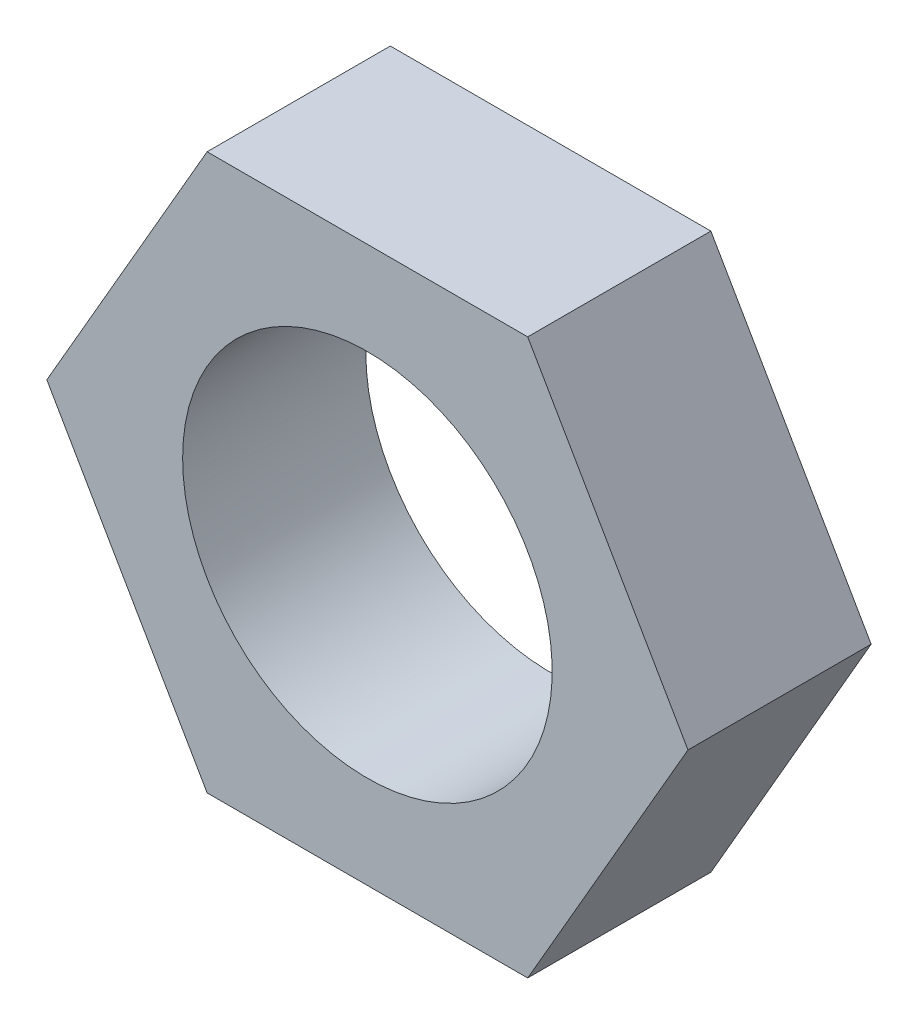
from build123d import *

# Parameters (mm, degrees)
SKETCH1_R           = 12.810731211
BOSS_EXTRUDE1_DEPTH = 12.7


with BuildPart() as part:
    # Sketch1 → Boss-Extrude1 (new body)
    with BuildSketch(Plane.XY.offset(12.7)):
        Polygon((11.1125, -19.247414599), (22.225, 0), (11.1125, 19.247414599), (-11.1125, 19.247414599), (-22.225, 0), (-11.1125, -19.247414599), align=None)
        with Locations(Location((0, 0, 0), (0, 0, 180))):
            Circle(SKETCH1_R, mode=Mode.SUBTRACT)
    extrude(amount=-BOSS_EXTRUDE1_DEPTH)


solid = part.part
